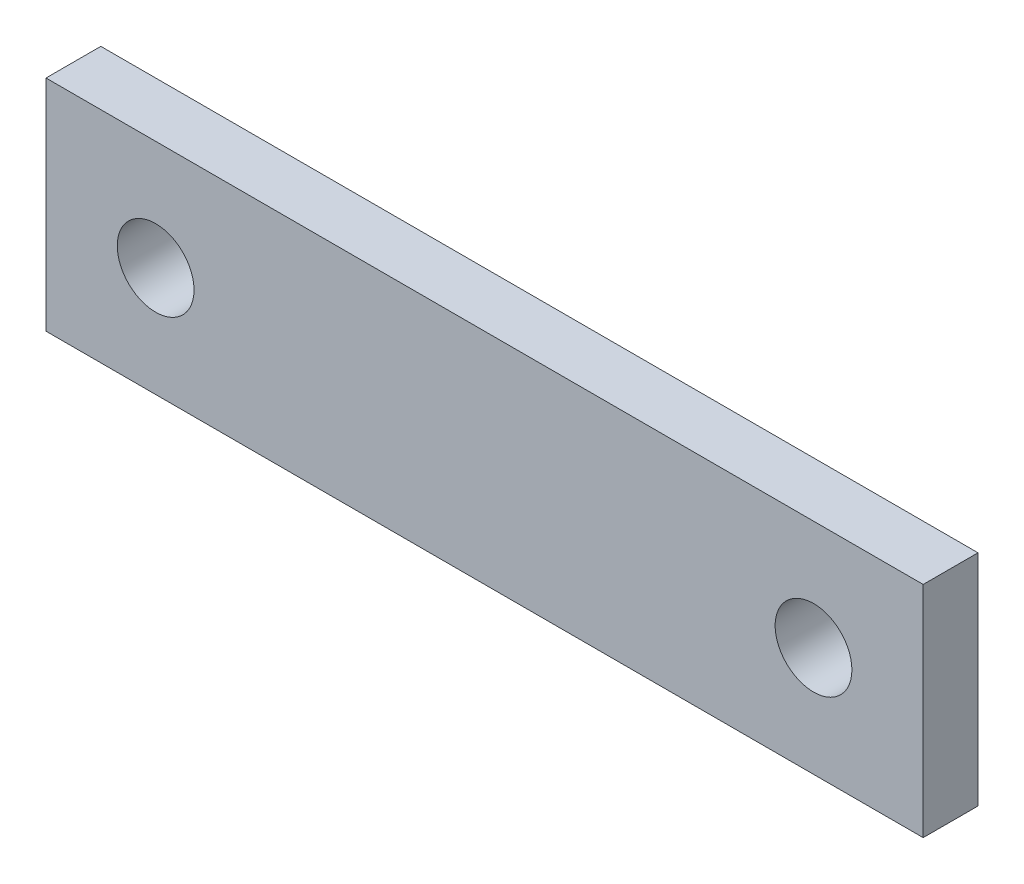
from build123d import *

# Parameters (mm, degrees)
ESQUISSE1_W       = 10
ESQUISSE1_H       = 40
EXTRUSION1_DEPTH  = 80
D_GAGEMENT_M131_D = 14


with BuildPart() as part:
    # Esquisse1 → Extrusion1 (new, symmetric)
    with BuildSketch(Plane(origin=(0, 0, 0), x_dir=(0, 0, -1), z_dir=(1, 0, 0))):
        with Locations((5, 0)):
            Rectangle(ESQUISSE1_W, ESQUISSE1_H)
    extrude(amount=EXTRUSION1_DEPTH, both=True)

    # D_gagement M131 (through all)
    with Locations(Plane.XY):
        with Locations((60, 0), (-60, 0)):
            Hole(D_GAGEMENT_M131_D / 2)


solid = part.part
